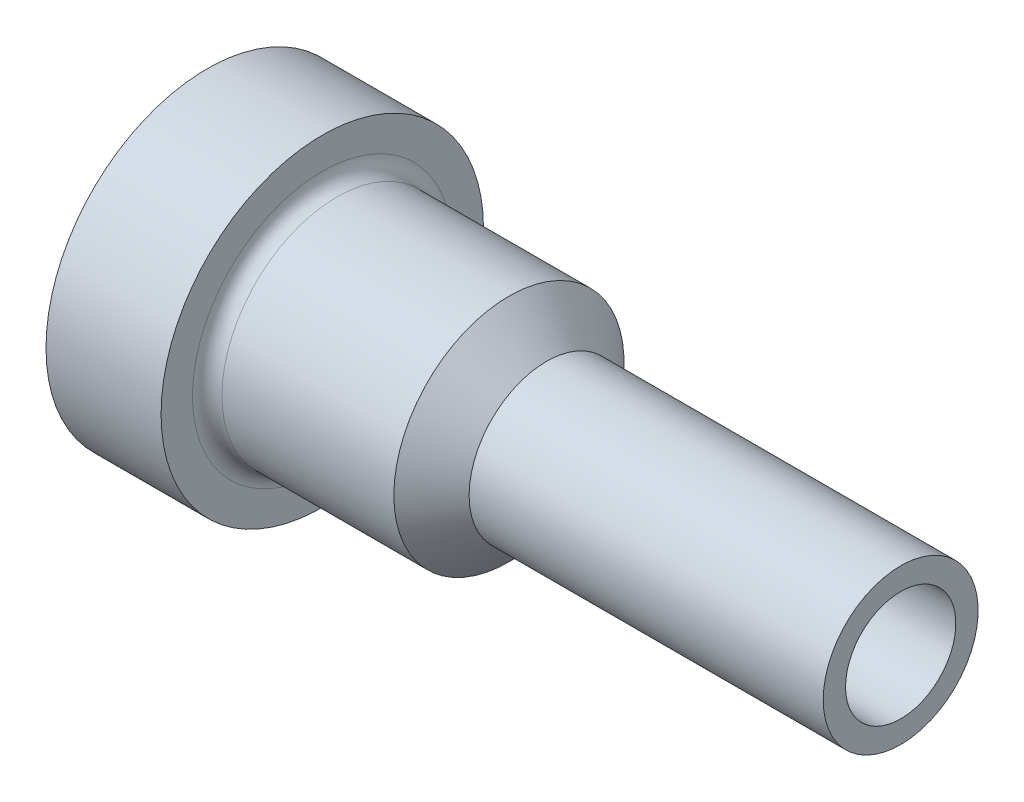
from build123d import *

# Parameters (mm, degrees)
SKETCH1_R              = 5.5499
BASE_EXTRUDE_DEPTH     = 23.876
F_10_24_TAPPED_HOLE1_D = 3.7973
CHAMFER1_SIZE          = 0.762
CHAMFER1_SIZE2         = 0.686107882
FILLET1_R              = 0.508


with BuildPart() as part:
    # Sketch1 → Base-Extrude (new body)
    with BuildSketch(Plane(origin=(0, 0, 0), x_dir=(0, 0, -1), z_dir=(1, 0, 0))):
        Circle(SKETCH1_R)
    extrude(amount=BASE_EXTRUDE_DEPTH)

    # Sketch2 → Cut-Revolve1 (revolve, cut)
    with BuildSketch(Plane.XY, mode=Mode.PRIVATE) as cut_revolve1_sk:
        Polygon((3.9624, 5.5499), (3.9624, 3.9624), (10.3886, 3.9624), (11.684, 2.667), (23.876, 2.667), (23.876, 5.5499), align=None)
    revolve(cut_revolve1_sk.sketch.rotate(Axis((0, 0, 0), (1, 0, 0)), 90), axis=Axis((0, 0, 0), (1, 0, 0)), mode=Mode.SUBTRACT)

    # 10-24 Tapped Hole1 (through all)
    with Locations(Plane.ZY):
        with Locations((0, 0)):
            Hole(F_10_24_TAPPED_HOLE1_D / 2)

    # Chamfer1
    chamfer1_edges = [part.edges().sort_by_distance(p)[0] for p in [
        (0, 0, 1.89865),
    ]]
    chamfer1_side = [part.faces().sort_by_distance(p)[0] for p in [
        (0, 0, 5.392925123),
    ]]
    chamfer(chamfer1_edges, length=CHAMFER1_SIZE, length2=CHAMFER1_SIZE2, reference=chamfer1_side[0])

    # Fillet1
    fillet1_edges = [part.edges().sort_by_distance(p)[0] for p in [
        (3.9624, 0, -3.9624),
    ]]
    fillet(fillet1_edges, radius=FILLET1_R)


solid = part.part
